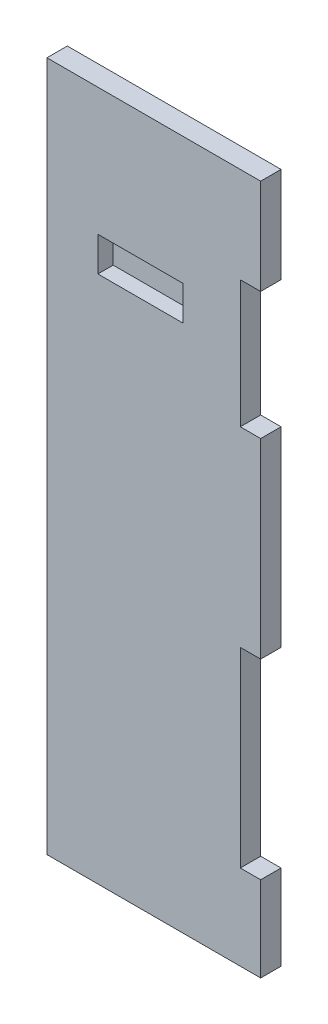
ISO-10303-21;
HEADER;
FILE_DESCRIPTION(('STEP AP214'),'2;1');
FILE_NAME('part.step','',(''),(''),'','','');
FILE_SCHEMA(('AUTOMOTIVE_DESIGN { 1 0 10303 214 1 1 1 1 }'));
ENDSEC;
DATA;
#1=APPLICATION_CONTEXT('core data for automotive mechanical design processes');
#2=APPLICATION_PROTOCOL_DEFINITION('international standard','automotive_design',2000,#1);
#3=PRODUCT_CONTEXT('',#1,'mechanical');
#4=PRODUCT('Part','Part','',(#3));
#5=PRODUCT_RELATED_PRODUCT_CATEGORY('part','',(#4));
#6=PRODUCT_DEFINITION_FORMATION('','',#4);
#7=PRODUCT_DEFINITION_CONTEXT('part definition',#1,'design');
#8=PRODUCT_DEFINITION('design','',#6,#7);
#9=PRODUCT_DEFINITION_SHAPE('','',#8);
#10=(LENGTH_UNIT() NAMED_UNIT(*) SI_UNIT(.MILLI.,.METRE.));
#11=(NAMED_UNIT(*) PLANE_ANGLE_UNIT() SI_UNIT($,.RADIAN.));
#12=(NAMED_UNIT(*) SI_UNIT($,.STERADIAN.) SOLID_ANGLE_UNIT());
#13=UNCERTAINTY_MEASURE_WITH_UNIT(LENGTH_MEASURE(1.E-05),#10,'distance_accuracy_value','');
#14=(GEOMETRIC_REPRESENTATION_CONTEXT(3) GLOBAL_UNCERTAINTY_ASSIGNED_CONTEXT((#13)) GLOBAL_UNIT_ASSIGNED_CONTEXT((#10,
#11,#12)) REPRESENTATION_CONTEXT('',''));
#15=CARTESIAN_POINT('',(0.,0.,0.));
#16=DIRECTION('',(0.,0.,1.));
#17=DIRECTION('',(1.,0.,0.));
#18=AXIS2_PLACEMENT_3D('',#15,#16,#17);
#19=CARTESIAN_POINT('',(0.,0.,0.));
#20=DIRECTION('',(0.,0.,1.));
#21=DIRECTION('',(1.,0.,0.));
#22=AXIS2_PLACEMENT_3D('',#19,#20,#21);
#23=PLANE('',#22);
#24=DIRECTION('',(-1.,0.,0.));
#25=VECTOR('',#24,1.);
#26=CARTESIAN_POINT('',(0.,76.2,0.));
#27=LINE('',#26,#25);
#28=CARTESIAN_POINT('',(167.8,76.2,0.));
#29=VERTEX_POINT('',#28);
#30=CARTESIAN_POINT('',(0.,76.2,0.));
#31=VERTEX_POINT('',#30);
#32=EDGE_CURVE('E284',#29,#31,#27,.T.);
#33=ORIENTED_EDGE('',*,*,#32,.T.);
#34=DIRECTION('',(0.,1.,0.));
#35=VECTOR('',#34,1.);
#36=CARTESIAN_POINT('',(0.,0.,0.));
#37=LINE('',#36,#35);
#38=CARTESIAN_POINT('',(0.,618.,0.));
#39=VERTEX_POINT('',#38);
#40=EDGE_CURVE('E295',#31,#39,#37,.T.);
#41=ORIENTED_EDGE('',*,*,#40,.T.);
#42=DIRECTION('',(1.,0.,0.));
#43=VECTOR('',#42,1.);
#44=CARTESIAN_POINT('',(0.,618.,0.));
#45=LINE('',#44,#43);
#46=CARTESIAN_POINT('',(167.8,618.,0.));
#47=VERTEX_POINT('',#46);
#48=EDGE_CURVE('E351',#39,#47,#45,.T.);
#49=ORIENTED_EDGE('',*,*,#48,.T.);
#50=DIRECTION('',(0.,1.,0.));
#51=VECTOR('',#50,1.);
#52=CARTESIAN_POINT('',(167.8,0.,0.));
#53=LINE('',#52,#51);
#54=CARTESIAN_POINT('',(167.8,543.,0.));
#55=VERTEX_POINT('',#54);
#56=EDGE_CURVE('E348',#55,#47,#53,.T.);
#57=ORIENTED_EDGE('',*,*,#56,.F.);
#58=DIRECTION('',(-1.,0.,0.));
#59=VECTOR('',#58,1.);
#60=CARTESIAN_POINT('',(0.,543.,0.));
#61=LINE('',#60,#59);
#62=CARTESIAN_POINT('',(151.8,543.,0.));
#63=VERTEX_POINT('',#62);
#64=EDGE_CURVE('E345',#55,#63,#61,.T.);
#65=ORIENTED_EDGE('',*,*,#64,.T.);
#66=DIRECTION('',(0.,-1.,0.));
#67=VECTOR('',#66,1.);
#68=CARTESIAN_POINT('',(151.8,0.,0.));
#69=LINE('',#68,#67);
#70=CARTESIAN_POINT('',(151.8,443.,0.));
#71=VERTEX_POINT('',#70);
#72=EDGE_CURVE('E342',#63,#71,#69,.T.);
#73=ORIENTED_EDGE('',*,*,#72,.T.);
#74=DIRECTION('',(-1.,0.,0.));
#75=VECTOR('',#74,1.);
#76=CARTESIAN_POINT('',(0.,443.,0.));
#77=LINE('',#76,#75);
#78=CARTESIAN_POINT('',(167.8,443.,0.));
#79=VERTEX_POINT('',#78);
#80=EDGE_CURVE('E339',#79,#71,#77,.T.);
#81=ORIENTED_EDGE('',*,*,#80,.F.);
#82=DIRECTION('',(0.,1.,0.));
#83=VECTOR('',#82,1.);
#84=CARTESIAN_POINT('',(167.8,0.,0.));
#85=LINE('',#84,#83);
#86=CARTESIAN_POINT('',(167.8,293.,0.));
#87=VERTEX_POINT('',#86);
#88=EDGE_CURVE('E337',#87,#79,#85,.T.);
#89=ORIENTED_EDGE('',*,*,#88,.F.);
#90=DIRECTION('',(-1.,0.,0.));
#91=VECTOR('',#90,1.);
#92=CARTESIAN_POINT('',(1.11022302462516E-12,293.000000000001,0.));
#93=LINE('',#92,#91);
#94=CARTESIAN_POINT('',(151.8,293.,0.));
#95=VERTEX_POINT('',#94);
#96=EDGE_CURVE('E334',#87,#95,#93,.T.);
#97=ORIENTED_EDGE('',*,*,#96,.T.);
#98=DIRECTION('',(0.,-1.,0.));
#99=VECTOR('',#98,1.);
#100=CARTESIAN_POINT('',(151.8,0.,0.));
#101=LINE('',#100,#99);
#102=CARTESIAN_POINT('',(151.8,143.,0.));
#103=VERTEX_POINT('',#102);
#104=EDGE_CURVE('E331',#95,#103,#101,.T.);
#105=ORIENTED_EDGE('',*,*,#104,.T.);
#106=DIRECTION('',(-1.,0.,0.));
#107=VECTOR('',#106,1.);
#108=CARTESIAN_POINT('',(0.,143.,0.));
#109=LINE('',#108,#107);
#110=CARTESIAN_POINT('',(167.8,143.,0.));
#111=VERTEX_POINT('',#110);
#112=EDGE_CURVE('E328',#111,#103,#109,.T.);
#113=ORIENTED_EDGE('',*,*,#112,.F.);
#114=DIRECTION('',(0.,1.,0.));
#115=VECTOR('',#114,1.);
#116=CARTESIAN_POINT('',(167.8,0.,0.));
#117=LINE('',#116,#115);
#118=EDGE_CURVE('E326',#29,#111,#117,.T.);
#119=ORIENTED_EDGE('',*,*,#118,.F.);
#120=EDGE_LOOP('',(#33,#41,#49,#57,#65,#73,#81,#89,#97,#105,#113,#119));
#121=FACE_BOUND('',#120,.T.);
#122=DIRECTION('',(0.,-1.,0.));
#123=VECTOR('',#122,1.);
#124=CARTESIAN_POINT('',(107.,0.,0.));
#125=LINE('',#124,#123);
#126=CARTESIAN_POINT('',(107.,518.,0.));
#127=VERTEX_POINT('',#126);
#128=CARTESIAN_POINT('',(107.,514.,0.));
#129=VERTEX_POINT('',#128);
#130=EDGE_CURVE('E12',#127,#129,#125,.T.);
#131=ORIENTED_EDGE('',*,*,#130,.F.);
#132=DIRECTION('',(-1.,0.,0.));
#133=VECTOR('',#132,1.);
#134=CARTESIAN_POINT('',(0.,518.,0.));
#135=LINE('',#134,#133);
#136=CARTESIAN_POINT('',(64.0000000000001,518.,0.));
#137=VERTEX_POINT('',#136);
#138=EDGE_CURVE('E381',#127,#137,#135,.T.);
#139=ORIENTED_EDGE('',*,*,#138,.T.);
#140=DIRECTION('',(0.,-1.,0.));
#141=VECTOR('',#140,1.);
#142=CARTESIAN_POINT('',(64.0000000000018,2.22044604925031E-13,0.));
#143=LINE('',#142,#141);
#144=CARTESIAN_POINT('',(64.0000000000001,514.,0.));
#145=VERTEX_POINT('',#144);
#146=EDGE_CURVE('E384',#137,#145,#143,.T.);
#147=ORIENTED_EDGE('',*,*,#146,.T.);
#148=DIRECTION('',(-1.,0.,0.));
#149=VECTOR('',#148,1.);
#150=CARTESIAN_POINT('',(0.,514.,0.));
#151=LINE('',#150,#149);
#152=EDGE_CURVE('E119',#129,#145,#151,.T.);
#153=ORIENTED_EDGE('',*,*,#152,.F.);
#154=EDGE_LOOP('',(#131,#139,#147,#153));
#155=FACE_BOUND('',#154,.T.);
#156=ADVANCED_FACE('F111',(#121,#155),#23,.F.);
#157=CARTESIAN_POINT('',(1.11022302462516E-12,293.000000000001,16.));
#158=DIRECTION('',(0.,-1.,0.));
#159=DIRECTION('',(1.,0.,0.));
#160=AXIS2_PLACEMENT_3D('',#157,#158,#159);
#161=PLANE('',#160);
#162=ORIENTED_EDGE('',*,*,#96,.F.);
#163=DIRECTION('',(0.,0.,-1.));
#164=VECTOR('',#163,1.);
#165=CARTESIAN_POINT('',(167.8,293.,16.));
#166=LINE('',#165,#164);
#167=CARTESIAN_POINT('',(167.8,293.,16.));
#168=VERTEX_POINT('',#167);
#169=EDGE_CURVE('E370',#168,#87,#166,.T.);
#170=ORIENTED_EDGE('',*,*,#169,.F.);
#171=DIRECTION('',(-1.,0.,0.));
#172=VECTOR('',#171,1.);
#173=CARTESIAN_POINT('',(1.11022302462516E-12,293.000000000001,16.));
#174=LINE('',#173,#172);
#175=CARTESIAN_POINT('',(151.8,293.,16.));
#176=VERTEX_POINT('',#175);
#177=EDGE_CURVE('E302',#168,#176,#174,.T.);
#178=ORIENTED_EDGE('',*,*,#177,.T.);
#179=DIRECTION('',(0.,0.,-1.));
#180=VECTOR('',#179,1.);
#181=CARTESIAN_POINT('',(151.8,293.,16.));
#182=LINE('',#181,#180);
#183=EDGE_CURVE('E372',#176,#95,#182,.T.);
#184=ORIENTED_EDGE('',*,*,#183,.T.);
#185=EDGE_LOOP('',(#162,#170,#178,#184));
#186=FACE_BOUND('',#185,.T.);
#187=ADVANCED_FACE('F415',(#186),#161,.T.);
#188=CARTESIAN_POINT('',(151.8,0.,16.));
#189=DIRECTION('',(1.,0.,0.));
#190=DIRECTION('',(0.,1.,0.));
#191=AXIS2_PLACEMENT_3D('',#188,#189,#190);
#192=PLANE('',#191);
#193=ORIENTED_EDGE('',*,*,#104,.F.);
#194=ORIENTED_EDGE('',*,*,#183,.F.);
#195=DIRECTION('',(0.,-1.,0.));
#196=VECTOR('',#195,1.);
#197=CARTESIAN_POINT('',(151.8,0.,16.));
#198=LINE('',#197,#196);
#199=CARTESIAN_POINT('',(151.8,143.,16.));
#200=VERTEX_POINT('',#199);
#201=EDGE_CURVE('E299',#176,#200,#198,.T.);
#202=ORIENTED_EDGE('',*,*,#201,.T.);
#203=DIRECTION('',(0.,0.,-1.));
#204=VECTOR('',#203,1.);
#205=CARTESIAN_POINT('',(151.8,143.,16.));
#206=LINE('',#205,#204);
#207=EDGE_CURVE('E374',#200,#103,#206,.T.);
#208=ORIENTED_EDGE('',*,*,#207,.T.);
#209=EDGE_LOOP('',(#193,#194,#202,#208));
#210=FACE_BOUND('',#209,.T.);
#211=ADVANCED_FACE('F421',(#210),#192,.T.);
#212=CARTESIAN_POINT('',(0.,143.,16.));
#213=DIRECTION('',(0.,-1.,0.));
#214=DIRECTION('',(0.,0.,-1.));
#215=AXIS2_PLACEMENT_3D('',#212,#213,#214);
#216=PLANE('',#215);
#217=ORIENTED_EDGE('',*,*,#112,.T.);
#218=ORIENTED_EDGE('',*,*,#207,.F.);
#219=DIRECTION('',(-1.,0.,0.));
#220=VECTOR('',#219,1.);
#221=CARTESIAN_POINT('',(0.,143.,16.));
#222=LINE('',#221,#220);
#223=CARTESIAN_POINT('',(167.8,143.,16.));
#224=VERTEX_POINT('',#223);
#225=EDGE_CURVE('E297',#224,#200,#222,.T.);
#226=ORIENTED_EDGE('',*,*,#225,.F.);
#227=DIRECTION('',(0.,0.,-1.));
#228=VECTOR('',#227,1.);
#229=CARTESIAN_POINT('',(167.8,143.,16.));
#230=LINE('',#229,#228);
#231=EDGE_CURVE('E376',#224,#111,#230,.T.);
#232=ORIENTED_EDGE('',*,*,#231,.T.);
#233=EDGE_LOOP('',(#217,#218,#226,#232));
#234=FACE_BOUND('',#233,.T.);
#235=ADVANCED_FACE('F456',(#234),#216,.F.);
#236=CARTESIAN_POINT('',(167.8,0.,16.));
#237=DIRECTION('',(-1.,0.,0.));
#238=DIRECTION('',(0.,0.,1.));
#239=AXIS2_PLACEMENT_3D('',#236,#237,#238);
#240=PLANE('',#239);
#241=ORIENTED_EDGE('',*,*,#118,.T.);
#242=ORIENTED_EDGE('',*,*,#231,.F.);
#243=DIRECTION('',(0.,1.,0.));
#244=VECTOR('',#243,1.);
#245=CARTESIAN_POINT('',(167.8,0.,16.));
#246=LINE('',#245,#244);
#247=CARTESIAN_POINT('',(167.8,76.2,16.));
#248=VERTEX_POINT('',#247);
#249=EDGE_CURVE('E294',#248,#224,#246,.T.);
#250=ORIENTED_EDGE('',*,*,#249,.F.);
#251=DIRECTION('',(0.,0.,-1.));
#252=VECTOR('',#251,1.);
#253=CARTESIAN_POINT('',(167.8,76.2,16.));
#254=LINE('',#253,#252);
#255=EDGE_CURVE('E379',#248,#29,#254,.T.);
#256=ORIENTED_EDGE('',*,*,#255,.T.);
#257=EDGE_LOOP('',(#241,#242,#250,#256));
#258=FACE_BOUND('',#257,.T.);
#259=ADVANCED_FACE('F459',(#258),#240,.F.);
#260=CARTESIAN_POINT('',(0.,76.2,16.));
#261=DIRECTION('',(0.,-1.,0.));
#262=DIRECTION('',(0.,0.,-1.));
#263=AXIS2_PLACEMENT_3D('',#260,#261,#262);
#264=PLANE('',#263);
#265=ORIENTED_EDGE('',*,*,#32,.F.);
#266=ORIENTED_EDGE('',*,*,#255,.F.);
#267=DIRECTION('',(-1.,0.,0.));
#268=VECTOR('',#267,1.);
#269=CARTESIAN_POINT('',(0.,76.2,16.));
#270=LINE('',#269,#268);
#271=CARTESIAN_POINT('',(0.,76.2,16.));
#272=VERTEX_POINT('',#271);
#273=EDGE_CURVE('E291',#248,#272,#270,.T.);
#274=ORIENTED_EDGE('',*,*,#273,.T.);
#275=DIRECTION('',(0.,0.,-1.));
#276=VECTOR('',#275,1.);
#277=CARTESIAN_POINT('',(0.,76.2,16.));
#278=LINE('',#277,#276);
#279=EDGE_CURVE('E323',#272,#31,#278,.T.);
#280=ORIENTED_EDGE('',*,*,#279,.T.);
#281=EDGE_LOOP('',(#265,#266,#274,#280));
#282=FACE_BOUND('',#281,.T.);
#283=ADVANCED_FACE('F113',(#282),#264,.T.);
#284=CARTESIAN_POINT('',(0.,0.,16.));
#285=DIRECTION('',(-1.,0.,0.));
#286=DIRECTION('',(0.,0.,1.));
#287=AXIS2_PLACEMENT_3D('',#284,#285,#286);
#288=PLANE('',#287);
#289=ORIENTED_EDGE('',*,*,#40,.F.);
#290=ORIENTED_EDGE('',*,*,#279,.F.);
#291=DIRECTION('',(0.,1.,0.));
#292=VECTOR('',#291,1.);
#293=CARTESIAN_POINT('',(0.,0.,16.));
#294=LINE('',#293,#292);
#295=CARTESIAN_POINT('',(0.,618.,16.));
#296=VERTEX_POINT('',#295);
#297=EDGE_CURVE('E320',#272,#296,#294,.T.);
#298=ORIENTED_EDGE('',*,*,#297,.T.);
#299=DIRECTION('',(0.,0.,-1.));
#300=VECTOR('',#299,1.);
#301=CARTESIAN_POINT('',(0.,618.,16.));
#302=LINE('',#301,#300);
#303=EDGE_CURVE('E357',#296,#39,#302,.T.);
#304=ORIENTED_EDGE('',*,*,#303,.T.);
#305=EDGE_LOOP('',(#289,#290,#298,#304));
#306=FACE_BOUND('',#305,.T.);
#307=ADVANCED_FACE('F426',(#306),#288,.T.);
#308=CARTESIAN_POINT('',(0.,618.,16.));
#309=DIRECTION('',(0.,1.,0.));
#310=DIRECTION('',(0.,0.,1.));
#311=AXIS2_PLACEMENT_3D('',#308,#309,#310);
#312=PLANE('',#311);
#313=ORIENTED_EDGE('',*,*,#48,.F.);
#314=ORIENTED_EDGE('',*,*,#303,.F.);
#315=DIRECTION('',(1.,0.,0.));
#316=VECTOR('',#315,1.);
#317=CARTESIAN_POINT('',(0.,618.,16.));
#318=LINE('',#317,#316);
#319=CARTESIAN_POINT('',(167.8,618.,16.));
#320=VERTEX_POINT('',#319);
#321=EDGE_CURVE('E317',#296,#320,#318,.T.);
#322=ORIENTED_EDGE('',*,*,#321,.T.);
#323=DIRECTION('',(0.,0.,-1.));
#324=VECTOR('',#323,1.);
#325=CARTESIAN_POINT('',(167.8,618.,16.));
#326=LINE('',#325,#324);
#327=EDGE_CURVE('E359',#320,#47,#326,.T.);
#328=ORIENTED_EDGE('',*,*,#327,.T.);
#329=EDGE_LOOP('',(#313,#314,#322,#328));
#330=FACE_BOUND('',#329,.T.);
#331=ADVANCED_FACE('F429',(#330),#312,.T.);
#332=CARTESIAN_POINT('',(167.8,0.,16.));
#333=DIRECTION('',(-1.,0.,0.));
#334=DIRECTION('',(0.,0.,1.));
#335=AXIS2_PLACEMENT_3D('',#332,#333,#334);
#336=PLANE('',#335);
#337=ORIENTED_EDGE('',*,*,#56,.T.);
#338=ORIENTED_EDGE('',*,*,#327,.F.);
#339=DIRECTION('',(0.,1.,0.));
#340=VECTOR('',#339,1.);
#341=CARTESIAN_POINT('',(167.8,0.,16.));
#342=LINE('',#341,#340);
#343=CARTESIAN_POINT('',(167.8,543.,16.));
#344=VERTEX_POINT('',#343);
#345=EDGE_CURVE('E315',#344,#320,#342,.T.);
#346=ORIENTED_EDGE('',*,*,#345,.F.);
#347=DIRECTION('',(0.,0.,-1.));
#348=VECTOR('',#347,1.);
#349=CARTESIAN_POINT('',(167.8,543.,16.));
#350=LINE('',#349,#348);
#351=EDGE_CURVE('E361',#344,#55,#350,.T.);
#352=ORIENTED_EDGE('',*,*,#351,.T.);
#353=EDGE_LOOP('',(#337,#338,#346,#352));
#354=FACE_BOUND('',#353,.T.);
#355=ADVANCED_FACE('F433',(#354),#336,.F.);
#356=CARTESIAN_POINT('',(0.,543.,16.));
#357=DIRECTION('',(0.,-1.,0.));
#358=DIRECTION('',(0.,0.,-1.));
#359=AXIS2_PLACEMENT_3D('',#356,#357,#358);
#360=PLANE('',#359);
#361=ORIENTED_EDGE('',*,*,#64,.F.);
#362=ORIENTED_EDGE('',*,*,#351,.F.);
#363=DIRECTION('',(-1.,0.,0.));
#364=VECTOR('',#363,1.);
#365=CARTESIAN_POINT('',(0.,543.,16.));
#366=LINE('',#365,#364);
#367=CARTESIAN_POINT('',(151.8,543.,16.));
#368=VERTEX_POINT('',#367);
#369=EDGE_CURVE('E312',#344,#368,#366,.T.);
#370=ORIENTED_EDGE('',*,*,#369,.T.);
#371=DIRECTION('',(0.,0.,-1.));
#372=VECTOR('',#371,1.);
#373=CARTESIAN_POINT('',(151.8,543.,16.));
#374=LINE('',#373,#372);
#375=EDGE_CURVE('E363',#368,#63,#374,.T.);
#376=ORIENTED_EDGE('',*,*,#375,.T.);
#377=EDGE_LOOP('',(#361,#362,#370,#376));
#378=FACE_BOUND('',#377,.T.);
#379=ADVANCED_FACE('F437',(#378),#360,.T.);
#380=CARTESIAN_POINT('',(151.8,0.,16.));
#381=DIRECTION('',(1.,0.,0.));
#382=DIRECTION('',(0.,1.,0.));
#383=AXIS2_PLACEMENT_3D('',#380,#381,#382);
#384=PLANE('',#383);
#385=ORIENTED_EDGE('',*,*,#72,.F.);
#386=ORIENTED_EDGE('',*,*,#375,.F.);
#387=DIRECTION('',(0.,-1.,0.));
#388=VECTOR('',#387,1.);
#389=CARTESIAN_POINT('',(151.8,0.,16.));
#390=LINE('',#389,#388);
#391=CARTESIAN_POINT('',(151.8,443.,16.));
#392=VERTEX_POINT('',#391);
#393=EDGE_CURVE('E309',#368,#392,#390,.T.);
#394=ORIENTED_EDGE('',*,*,#393,.T.);
#395=DIRECTION('',(0.,0.,-1.));
#396=VECTOR('',#395,1.);
#397=CARTESIAN_POINT('',(151.8,443.,16.));
#398=LINE('',#397,#396);
#399=EDGE_CURVE('E365',#392,#71,#398,.T.);
#400=ORIENTED_EDGE('',*,*,#399,.T.);
#401=EDGE_LOOP('',(#385,#386,#394,#400));
#402=FACE_BOUND('',#401,.T.);
#403=ADVANCED_FACE('F441',(#402),#384,.T.);
#404=CARTESIAN_POINT('',(0.,443.,16.));
#405=DIRECTION('',(0.,-1.,0.));
#406=DIRECTION('',(0.,0.,-1.));
#407=AXIS2_PLACEMENT_3D('',#404,#405,#406);
#408=PLANE('',#407);
#409=ORIENTED_EDGE('',*,*,#80,.T.);
#410=ORIENTED_EDGE('',*,*,#399,.F.);
#411=DIRECTION('',(-1.,0.,0.));
#412=VECTOR('',#411,1.);
#413=CARTESIAN_POINT('',(0.,443.,16.));
#414=LINE('',#413,#412);
#415=CARTESIAN_POINT('',(167.8,443.,16.));
#416=VERTEX_POINT('',#415);
#417=EDGE_CURVE('E307',#416,#392,#414,.T.);
#418=ORIENTED_EDGE('',*,*,#417,.F.);
#419=DIRECTION('',(0.,0.,-1.));
#420=VECTOR('',#419,1.);
#421=CARTESIAN_POINT('',(167.8,443.,16.));
#422=LINE('',#421,#420);
#423=EDGE_CURVE('E367',#416,#79,#422,.T.);
#424=ORIENTED_EDGE('',*,*,#423,.T.);
#425=EDGE_LOOP('',(#409,#410,#418,#424));
#426=FACE_BOUND('',#425,.T.);
#427=ADVANCED_FACE('F445',(#426),#408,.F.);
#428=CARTESIAN_POINT('',(167.8,0.,16.));
#429=DIRECTION('',(-1.,0.,0.));
#430=DIRECTION('',(0.,0.,1.));
#431=AXIS2_PLACEMENT_3D('',#428,#429,#430);
#432=PLANE('',#431);
#433=ORIENTED_EDGE('',*,*,#88,.T.);
#434=ORIENTED_EDGE('',*,*,#423,.F.);
#435=DIRECTION('',(0.,1.,0.));
#436=VECTOR('',#435,1.);
#437=CARTESIAN_POINT('',(167.8,0.,16.));
#438=LINE('',#437,#436);
#439=EDGE_CURVE('E305',#168,#416,#438,.T.);
#440=ORIENTED_EDGE('',*,*,#439,.F.);
#441=ORIENTED_EDGE('',*,*,#169,.T.);
#442=EDGE_LOOP('',(#433,#434,#440,#441));
#443=FACE_BOUND('',#442,.T.);
#444=ADVANCED_FACE('F449',(#443),#432,.F.);
#445=CARTESIAN_POINT('',(0.,0.,16.));
#446=DIRECTION('',(0.,0.,1.));
#447=DIRECTION('',(1.,0.,0.));
#448=AXIS2_PLACEMENT_3D('',#445,#446,#447);
#449=PLANE('',#448);
#450=DIRECTION('',(0.,-1.,0.));
#451=VECTOR('',#450,1.);
#452=CARTESIAN_POINT('',(40.,518.,16.));
#453=LINE('',#452,#451);
#454=CARTESIAN_POINT('',(40.,518.,16.));
#455=VERTEX_POINT('',#454);
#456=CARTESIAN_POINT('',(40.,491.,16.));
#457=VERTEX_POINT('',#456);
#458=EDGE_CURVE('E253',#455,#457,#453,.T.);
#459=ORIENTED_EDGE('',*,*,#458,.F.);
#460=DIRECTION('',(-1.,0.,0.));
#461=VECTOR('',#460,1.);
#462=CARTESIAN_POINT('',(40.,518.,16.));
#463=LINE('',#462,#461);
#464=CARTESIAN_POINT('',(107.,518.,16.));
#465=VERTEX_POINT('',#464);
#466=EDGE_CURVE('E279',#465,#455,#463,.T.);
#467=ORIENTED_EDGE('',*,*,#466,.F.);
#468=DIRECTION('',(0.,1.,0.));
#469=VECTOR('',#468,1.);
#470=CARTESIAN_POINT('',(107.,518.,16.));
#471=LINE('',#470,#469);
#472=CARTESIAN_POINT('',(107.,491.,16.));
#473=VERTEX_POINT('',#472);
#474=EDGE_CURVE('E277',#473,#465,#471,.T.);
#475=ORIENTED_EDGE('',*,*,#474,.F.);
#476=DIRECTION('',(1.,0.,0.));
#477=VECTOR('',#476,1.);
#478=CARTESIAN_POINT('',(40.,491.,16.));
#479=LINE('',#478,#477);
#480=EDGE_CURVE('E274',#457,#473,#479,.T.);
#481=ORIENTED_EDGE('',*,*,#480,.F.);
#482=EDGE_LOOP('',(#459,#467,#475,#481));
#483=FACE_BOUND('',#482,.T.);
#484=ORIENTED_EDGE('',*,*,#273,.F.);
#485=ORIENTED_EDGE('',*,*,#249,.T.);
#486=ORIENTED_EDGE('',*,*,#225,.T.);
#487=ORIENTED_EDGE('',*,*,#201,.F.);
#488=ORIENTED_EDGE('',*,*,#177,.F.);
#489=ORIENTED_EDGE('',*,*,#439,.T.);
#490=ORIENTED_EDGE('',*,*,#417,.T.);
#491=ORIENTED_EDGE('',*,*,#393,.F.);
#492=ORIENTED_EDGE('',*,*,#369,.F.);
#493=ORIENTED_EDGE('',*,*,#345,.T.);
#494=ORIENTED_EDGE('',*,*,#321,.F.);
#495=ORIENTED_EDGE('',*,*,#297,.F.);
#496=EDGE_LOOP('',(#484,#485,#486,#487,#488,#489,#490,#491,#492,#493,#494,#495));
#497=FACE_BOUND('',#496,.T.);
#498=ADVANCED_FACE('F396',(#483,#497),#449,.T.);
#499=CARTESIAN_POINT('',(40.,518.,4.));
#500=DIRECTION('',(-1.,0.,0.));
#501=DIRECTION('',(0.,-1.,0.));
#502=AXIS2_PLACEMENT_3D('',#499,#500,#501);
#503=PLANE('',#502);
#504=ORIENTED_EDGE('',*,*,#458,.T.);
#505=DIRECTION('',(0.,0.,1.));
#506=VECTOR('',#505,1.);
#507=CARTESIAN_POINT('',(40.,491.,4.));
#508=LINE('',#507,#506);
#509=CARTESIAN_POINT('',(40.,491.,4.));
#510=VERTEX_POINT('',#509);
#511=EDGE_CURVE('E267',#510,#457,#508,.T.);
#512=ORIENTED_EDGE('',*,*,#511,.F.);
#513=DIRECTION('',(0.,-1.,0.));
#514=VECTOR('',#513,1.);
#515=CARTESIAN_POINT('',(40.,518.,4.));
#516=LINE('',#515,#514);
#517=CARTESIAN_POINT('',(40.,518.,4.));
#518=VERTEX_POINT('',#517);
#519=EDGE_CURVE('E269',#518,#510,#516,.T.);
#520=ORIENTED_EDGE('',*,*,#519,.F.);
#521=DIRECTION('',(0.,0.,1.));
#522=VECTOR('',#521,1.);
#523=CARTESIAN_POINT('',(40.,518.,4.));
#524=LINE('',#523,#522);
#525=EDGE_CURVE('E282',#518,#455,#524,.T.);
#526=ORIENTED_EDGE('',*,*,#525,.T.);
#527=EDGE_LOOP('',(#504,#512,#520,#526));
#528=FACE_BOUND('',#527,.T.);
#529=ADVANCED_FACE('F399',(#528),#503,.F.);
#530=CARTESIAN_POINT('',(40.,518.,4.));
#531=DIRECTION('',(0.,1.,0.));
#532=DIRECTION('',(0.,0.,1.));
#533=AXIS2_PLACEMENT_3D('',#530,#531,#532);
#534=PLANE('',#533);
#535=ORIENTED_EDGE('',*,*,#466,.T.);
#536=ORIENTED_EDGE('',*,*,#525,.F.);
#537=DIRECTION('',(-1.,0.,0.));
#538=VECTOR('',#537,1.);
#539=CARTESIAN_POINT('',(40.,518.,4.));
#540=LINE('',#539,#538);
#541=CARTESIAN_POINT('',(64.0000000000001,518.,4.));
#542=VERTEX_POINT('',#541);
#543=EDGE_CURVE('E265',#542,#518,#540,.T.);
#544=ORIENTED_EDGE('',*,*,#543,.F.);
#545=DIRECTION('',(0.,0.,1.));
#546=VECTOR('',#545,1.);
#547=CARTESIAN_POINT('',(64.0000000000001,518.,-2.));
#548=LINE('',#547,#546);
#549=EDGE_CURVE('E133',#137,#542,#548,.T.);
#550=ORIENTED_EDGE('',*,*,#549,.F.);
#551=ORIENTED_EDGE('',*,*,#138,.F.);
#552=DIRECTION('',(0.,0.,1.));
#553=VECTOR('',#552,1.);
#554=CARTESIAN_POINT('',(107.,518.,4.));
#555=LINE('',#554,#553);
#556=EDGE_CURVE('E285',#127,#465,#555,.T.);
#557=ORIENTED_EDGE('',*,*,#556,.T.);
#558=EDGE_LOOP('',(#535,#536,#544,#550,#551,#557));
#559=FACE_BOUND('',#558,.T.);
#560=ADVANCED_FACE('F389',(#559),#534,.F.);
#561=CARTESIAN_POINT('',(107.,518.,4.));
#562=DIRECTION('',(1.,0.,0.));
#563=DIRECTION('',(0.,0.,-1.));
#564=AXIS2_PLACEMENT_3D('',#561,#562,#563);
#565=PLANE('',#564);
#566=ORIENTED_EDGE('',*,*,#474,.T.);
#567=ORIENTED_EDGE('',*,*,#556,.F.);
#568=ORIENTED_EDGE('',*,*,#130,.T.);
#569=DIRECTION('',(0.,0.,1.));
#570=VECTOR('',#569,1.);
#571=CARTESIAN_POINT('',(107.,514.,-2.));
#572=LINE('',#571,#570);
#573=CARTESIAN_POINT('',(107.,514.,4.));
#574=VERTEX_POINT('',#573);
#575=EDGE_CURVE('E243',#129,#574,#572,.T.);
#576=ORIENTED_EDGE('',*,*,#575,.T.);
#577=DIRECTION('',(0.,1.,0.));
#578=VECTOR('',#577,1.);
#579=CARTESIAN_POINT('',(107.,518.,4.));
#580=LINE('',#579,#578);
#581=CARTESIAN_POINT('',(107.,491.,4.));
#582=VERTEX_POINT('',#581);
#583=EDGE_CURVE('E248',#582,#574,#580,.T.);
#584=ORIENTED_EDGE('',*,*,#583,.F.);
#585=DIRECTION('',(0.,0.,1.));
#586=VECTOR('',#585,1.);
#587=CARTESIAN_POINT('',(107.,491.,4.));
#588=LINE('',#587,#586);
#589=EDGE_CURVE('E287',#582,#473,#588,.T.);
#590=ORIENTED_EDGE('',*,*,#589,.T.);
#591=EDGE_LOOP('',(#566,#567,#568,#576,#584,#590));
#592=FACE_BOUND('',#591,.T.);
#593=ADVANCED_FACE('F246',(#592),#565,.F.);
#594=CARTESIAN_POINT('',(40.,491.,4.));
#595=DIRECTION('',(0.,-1.,0.));
#596=DIRECTION('',(0.,0.,-1.));
#597=AXIS2_PLACEMENT_3D('',#594,#595,#596);
#598=PLANE('',#597);
#599=ORIENTED_EDGE('',*,*,#480,.T.);
#600=ORIENTED_EDGE('',*,*,#589,.F.);
#601=DIRECTION('',(1.,0.,0.));
#602=VECTOR('',#601,1.);
#603=CARTESIAN_POINT('',(40.,491.,4.));
#604=LINE('',#603,#602);
#605=EDGE_CURVE('E264',#510,#582,#604,.T.);
#606=ORIENTED_EDGE('',*,*,#605,.F.);
#607=ORIENTED_EDGE('',*,*,#511,.T.);
#608=EDGE_LOOP('',(#599,#600,#606,#607));
#609=FACE_BOUND('',#608,.T.);
#610=ADVANCED_FACE('F402',(#609),#598,.F.);
#611=CARTESIAN_POINT('',(0.,0.,4.));
#612=DIRECTION('',(0.,0.,1.));
#613=DIRECTION('',(1.,0.,0.));
#614=AXIS2_PLACEMENT_3D('',#611,#612,#613);
#615=PLANE('',#614);
#616=DIRECTION('',(0.,-1.,0.));
#617=VECTOR('',#616,1.);
#618=CARTESIAN_POINT('',(64.0000000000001,518.,4.));
#619=LINE('',#618,#617);
#620=CARTESIAN_POINT('',(64.0000000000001,514.,4.));
#621=VERTEX_POINT('',#620);
#622=EDGE_CURVE('E126',#542,#621,#619,.T.);
#623=ORIENTED_EDGE('',*,*,#622,.F.);
#624=ORIENTED_EDGE('',*,*,#543,.T.);
#625=ORIENTED_EDGE('',*,*,#519,.T.);
#626=ORIENTED_EDGE('',*,*,#605,.T.);
#627=ORIENTED_EDGE('',*,*,#583,.T.);
#628=DIRECTION('',(-1.,0.,0.));
#629=VECTOR('',#628,1.);
#630=CARTESIAN_POINT('',(107.,514.,4.));
#631=LINE('',#630,#629);
#632=EDGE_CURVE('E257',#574,#621,#631,.T.);
#633=ORIENTED_EDGE('',*,*,#632,.T.);
#634=EDGE_LOOP('',(#623,#624,#625,#626,#627,#633));
#635=FACE_BOUND('',#634,.T.);
#636=ADVANCED_FACE('F261',(#635),#615,.T.);
#637=CARTESIAN_POINT('',(107.,514.,-2.));
#638=DIRECTION('',(0.,1.,0.));
#639=DIRECTION('',(0.,0.,1.));
#640=AXIS2_PLACEMENT_3D('',#637,#638,#639);
#641=PLANE('',#640);
#642=ORIENTED_EDGE('',*,*,#152,.T.);
#643=DIRECTION('',(0.,0.,1.));
#644=VECTOR('',#643,1.);
#645=CARTESIAN_POINT('',(64.0000000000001,514.,-2.));
#646=LINE('',#645,#644);
#647=EDGE_CURVE('E254',#145,#621,#646,.T.);
#648=ORIENTED_EDGE('',*,*,#647,.T.);
#649=ORIENTED_EDGE('',*,*,#632,.F.);
#650=ORIENTED_EDGE('',*,*,#575,.F.);
#651=EDGE_LOOP('',(#642,#648,#649,#650));
#652=FACE_BOUND('',#651,.T.);
#653=ADVANCED_FACE('F258',(#652),#641,.T.);
#654=CARTESIAN_POINT('',(64.0000000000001,518.,-2.));
#655=DIRECTION('',(-1.,0.,0.));
#656=DIRECTION('',(0.,-1.,0.));
#657=AXIS2_PLACEMENT_3D('',#654,#655,#656);
#658=PLANE('',#657);
#659=ORIENTED_EDGE('',*,*,#549,.T.);
#660=ORIENTED_EDGE('',*,*,#622,.T.);
#661=ORIENTED_EDGE('',*,*,#647,.F.);
#662=ORIENTED_EDGE('',*,*,#146,.F.);
#663=EDGE_LOOP('',(#659,#660,#661,#662));
#664=FACE_BOUND('',#663,.T.);
#665=ADVANCED_FACE('F387',(#664),#658,.F.);
#666=CLOSED_SHELL('',(#156,#187,#211,#235,#259,#283,#307,#331,#355,#379,#403,#427,#444,#498,
#529,#560,#593,#610,#636,#653,#665));
#667=MANIFOLD_SOLID_BREP('B2',#666);
#668=ADVANCED_BREP_SHAPE_REPRESENTATION('',(#18,#667),#14);
#669=SHAPE_DEFINITION_REPRESENTATION(#9,#668);
ENDSEC;
END-ISO-10303-21;
